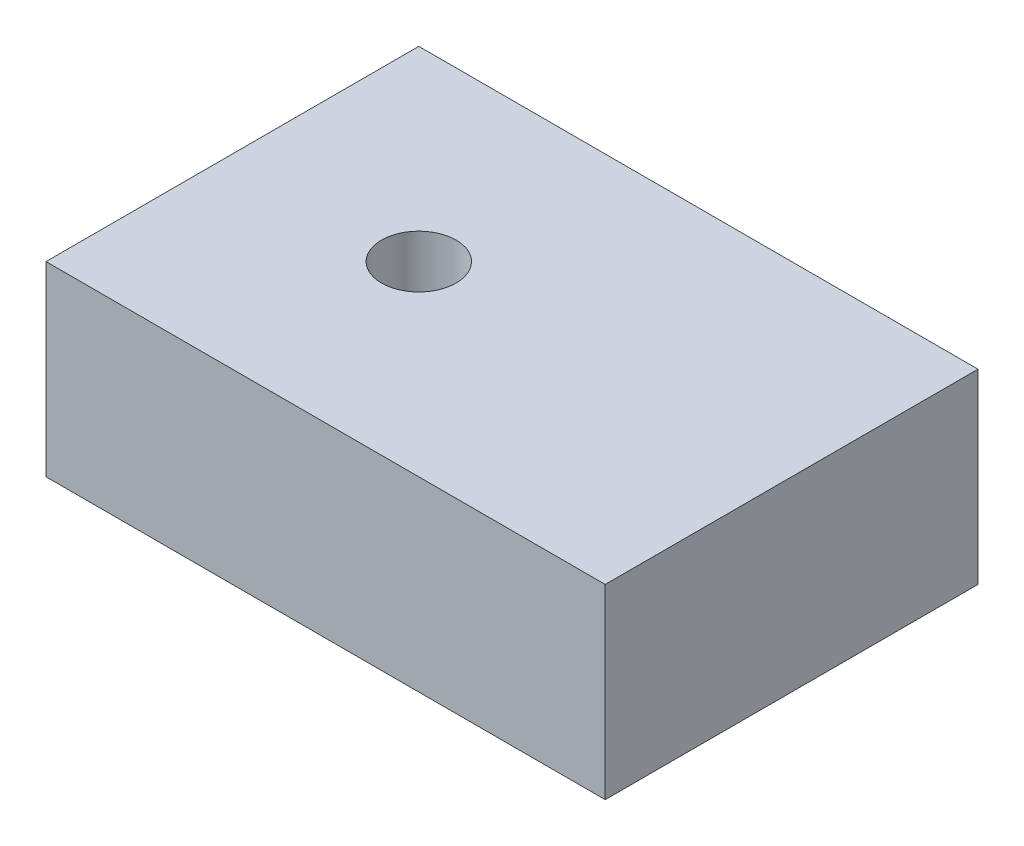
ISO-10303-21;
HEADER;
FILE_DESCRIPTION(('STEP AP214'),'2;1');
FILE_NAME('part.step','',(''),(''),'','','');
FILE_SCHEMA(('AUTOMOTIVE_DESIGN { 1 0 10303 214 1 1 1 1 }'));
ENDSEC;
DATA;
#1=APPLICATION_CONTEXT('core data for automotive mechanical design processes');
#2=APPLICATION_PROTOCOL_DEFINITION('international standard','automotive_design',2000,#1);
#3=PRODUCT_CONTEXT('',#1,'mechanical');
#4=PRODUCT('Part','Part','',(#3));
#5=PRODUCT_RELATED_PRODUCT_CATEGORY('part','',(#4));
#6=PRODUCT_DEFINITION_FORMATION('','',#4);
#7=PRODUCT_DEFINITION_CONTEXT('part definition',#1,'design');
#8=PRODUCT_DEFINITION('design','',#6,#7);
#9=PRODUCT_DEFINITION_SHAPE('','',#8);
#10=(LENGTH_UNIT() NAMED_UNIT(*) SI_UNIT(.MILLI.,.METRE.));
#11=(NAMED_UNIT(*) PLANE_ANGLE_UNIT() SI_UNIT($,.RADIAN.));
#12=(NAMED_UNIT(*) SI_UNIT($,.STERADIAN.) SOLID_ANGLE_UNIT());
#13=UNCERTAINTY_MEASURE_WITH_UNIT(LENGTH_MEASURE(1.E-05),#10,'distance_accuracy_value','');
#14=(GEOMETRIC_REPRESENTATION_CONTEXT(3) GLOBAL_UNCERTAINTY_ASSIGNED_CONTEXT((#13)) GLOBAL_UNIT_ASSIGNED_CONTEXT((#10,
#11,#12)) REPRESENTATION_CONTEXT('',''));
#15=CARTESIAN_POINT('',(0.,0.,0.));
#16=DIRECTION('',(0.,0.,1.));
#17=DIRECTION('',(1.,0.,0.));
#18=AXIS2_PLACEMENT_3D('',#15,#16,#17);
#19=CARTESIAN_POINT('',(-30.,10.,-20.));
#20=DIRECTION('',(1.,0.,0.));
#21=DIRECTION('',(0.,0.,-1.));
#22=AXIS2_PLACEMENT_3D('',#19,#20,#21);
#23=PLANE('',#22);
#24=DIRECTION('',(0.,0.,1.));
#25=VECTOR('',#24,1.);
#26=CARTESIAN_POINT('',(-30.,0.,-20.));
#27=LINE('',#26,#25);
#28=CARTESIAN_POINT('',(-30.,0.,-20.));
#29=VERTEX_POINT('',#28);
#30=CARTESIAN_POINT('',(-30.,0.,0.));
#31=VERTEX_POINT('',#30);
#32=EDGE_CURVE('E94',#29,#31,#27,.T.);
#33=ORIENTED_EDGE('',*,*,#32,.T.);
#34=DIRECTION('',(0.,-1.,0.));
#35=VECTOR('',#34,1.);
#36=CARTESIAN_POINT('',(-30.,10.,0.));
#37=LINE('',#36,#35);
#38=CARTESIAN_POINT('',(-30.,10.,0.));
#39=VERTEX_POINT('',#38);
#40=EDGE_CURVE('E11',#39,#31,#37,.T.);
#41=ORIENTED_EDGE('',*,*,#40,.F.);
#42=DIRECTION('',(0.,0.,1.));
#43=VECTOR('',#42,1.);
#44=CARTESIAN_POINT('',(-30.,10.,-20.));
#45=LINE('',#44,#43);
#46=CARTESIAN_POINT('',(-30.,10.,-20.));
#47=VERTEX_POINT('',#46);
#48=EDGE_CURVE('E82',#47,#39,#45,.T.);
#49=ORIENTED_EDGE('',*,*,#48,.F.);
#50=DIRECTION('',(0.,-1.,0.));
#51=VECTOR('',#50,1.);
#52=CARTESIAN_POINT('',(-30.,10.,-20.));
#53=LINE('',#52,#51);
#54=EDGE_CURVE('E90',#47,#29,#53,.T.);
#55=ORIENTED_EDGE('',*,*,#54,.T.);
#56=EDGE_LOOP('',(#33,#41,#49,#55));
#57=FACE_BOUND('',#56,.T.);
#58=ADVANCED_FACE('F31',(#57),#23,.F.);
#59=CARTESIAN_POINT('',(-30.,10.,0.));
#60=DIRECTION('',(0.,0.,-1.));
#61=DIRECTION('',(-1.,0.,0.));
#62=AXIS2_PLACEMENT_3D('',#59,#60,#61);
#63=PLANE('',#62);
#64=DIRECTION('',(1.,0.,0.));
#65=VECTOR('',#64,1.);
#66=CARTESIAN_POINT('',(-30.,0.,0.));
#67=LINE('',#66,#65);
#68=CARTESIAN_POINT('',(0.,0.,0.));
#69=VERTEX_POINT('',#68);
#70=EDGE_CURVE('E86',#31,#69,#67,.T.);
#71=ORIENTED_EDGE('',*,*,#70,.T.);
#72=DIRECTION('',(0.,-1.,0.));
#73=VECTOR('',#72,1.);
#74=CARTESIAN_POINT('',(0.,10.,0.));
#75=LINE('',#74,#73);
#76=CARTESIAN_POINT('',(0.,10.,0.));
#77=VERTEX_POINT('',#76);
#78=EDGE_CURVE('E39',#77,#69,#75,.T.);
#79=ORIENTED_EDGE('',*,*,#78,.F.);
#80=DIRECTION('',(1.,0.,0.));
#81=VECTOR('',#80,1.);
#82=CARTESIAN_POINT('',(-30.,10.,0.));
#83=LINE('',#82,#81);
#84=EDGE_CURVE('E77',#39,#77,#83,.T.);
#85=ORIENTED_EDGE('',*,*,#84,.F.);
#86=ORIENTED_EDGE('',*,*,#40,.T.);
#87=EDGE_LOOP('',(#71,#79,#85,#86));
#88=FACE_BOUND('',#87,.T.);
#89=ADVANCED_FACE('F85',(#88),#63,.F.);
#90=CARTESIAN_POINT('',(0.,10.,-20.));
#91=DIRECTION('',(-1.,0.,0.));
#92=DIRECTION('',(0.,0.,1.));
#93=AXIS2_PLACEMENT_3D('',#90,#91,#92);
#94=PLANE('',#93);
#95=DIRECTION('',(0.,0.,-1.));
#96=VECTOR('',#95,1.);
#97=CARTESIAN_POINT('',(0.,0.,-20.));
#98=LINE('',#97,#96);
#99=CARTESIAN_POINT('',(0.,0.,-20.));
#100=VERTEX_POINT('',#99);
#101=EDGE_CURVE('E64',#69,#100,#98,.T.);
#102=ORIENTED_EDGE('',*,*,#101,.T.);
#103=DIRECTION('',(0.,-1.,0.));
#104=VECTOR('',#103,1.);
#105=CARTESIAN_POINT('',(0.,10.,-20.));
#106=LINE('',#105,#104);
#107=CARTESIAN_POINT('',(0.,10.,-20.));
#108=VERTEX_POINT('',#107);
#109=EDGE_CURVE('E87',#108,#100,#106,.T.);
#110=ORIENTED_EDGE('',*,*,#109,.F.);
#111=DIRECTION('',(0.,0.,-1.));
#112=VECTOR('',#111,1.);
#113=CARTESIAN_POINT('',(0.,10.,-20.));
#114=LINE('',#113,#112);
#115=EDGE_CURVE('E80',#77,#108,#114,.T.);
#116=ORIENTED_EDGE('',*,*,#115,.F.);
#117=ORIENTED_EDGE('',*,*,#78,.T.);
#118=EDGE_LOOP('',(#102,#110,#116,#117));
#119=FACE_BOUND('',#118,.T.);
#120=ADVANCED_FACE('F88',(#119),#94,.F.);
#121=CARTESIAN_POINT('',(-30.,10.,-20.));
#122=DIRECTION('',(0.,0.,1.));
#123=DIRECTION('',(1.,0.,0.));
#124=AXIS2_PLACEMENT_3D('',#121,#122,#123);
#125=PLANE('',#124);
#126=DIRECTION('',(-1.,0.,0.));
#127=VECTOR('',#126,1.);
#128=CARTESIAN_POINT('',(-30.,0.,-20.));
#129=LINE('',#128,#127);
#130=EDGE_CURVE('E70',#100,#29,#129,.T.);
#131=ORIENTED_EDGE('',*,*,#130,.T.);
#132=ORIENTED_EDGE('',*,*,#54,.F.);
#133=DIRECTION('',(-1.,0.,0.));
#134=VECTOR('',#133,1.);
#135=CARTESIAN_POINT('',(-30.,10.,-20.));
#136=LINE('',#135,#134);
#137=EDGE_CURVE('E47',#108,#47,#136,.T.);
#138=ORIENTED_EDGE('',*,*,#137,.F.);
#139=ORIENTED_EDGE('',*,*,#109,.T.);
#140=EDGE_LOOP('',(#131,#132,#138,#139));
#141=FACE_BOUND('',#140,.T.);
#142=ADVANCED_FACE('F102',(#141),#125,.F.);
#143=CARTESIAN_POINT('',(-30.,10.,0.));
#144=DIRECTION('',(0.,1.,0.));
#145=DIRECTION('',(0.,0.,1.));
#146=AXIS2_PLACEMENT_3D('',#143,#144,#145);
#147=PLANE('',#146);
#148=CARTESIAN_POINT('',(-20.,10.,-10.));
#149=DIRECTION('',(0.,1.,0.));
#150=DIRECTION('',(0.,0.,1.));
#151=AXIS2_PLACEMENT_3D('',#148,#149,#150);
#152=CIRCLE('',#151,2.);
#153=CARTESIAN_POINT('',(-20.,10.,-8.));
#154=VERTEX_POINT('',#153);
#155=EDGE_CURVE('E108',#154,#154,#152,.T.);
#156=ORIENTED_EDGE('',*,*,#155,.F.);
#157=EDGE_LOOP('',(#156));
#158=FACE_BOUND('',#157,.T.);
#159=ORIENTED_EDGE('',*,*,#48,.T.);
#160=ORIENTED_EDGE('',*,*,#84,.T.);
#161=ORIENTED_EDGE('',*,*,#115,.T.);
#162=ORIENTED_EDGE('',*,*,#137,.T.);
#163=EDGE_LOOP('',(#159,#160,#161,#162));
#164=FACE_BOUND('',#163,.T.);
#165=ADVANCED_FACE('F78',(#158,#164),#147,.T.);
#166=CARTESIAN_POINT('',(-30.,0.,0.));
#167=DIRECTION('',(0.,1.,0.));
#168=DIRECTION('',(0.,0.,1.));
#169=AXIS2_PLACEMENT_3D('',#166,#167,#168);
#170=PLANE('',#169);
#171=CARTESIAN_POINT('',(-20.,0.,-10.));
#172=DIRECTION('',(0.,1.,0.));
#173=DIRECTION('',(0.,0.,1.));
#174=AXIS2_PLACEMENT_3D('',#171,#172,#173);
#175=CIRCLE('',#174,2.);
#176=CARTESIAN_POINT('',(-20.,0.,-8.));
#177=VERTEX_POINT('',#176);
#178=EDGE_CURVE('E97',#177,#177,#175,.T.);
#179=ORIENTED_EDGE('',*,*,#178,.T.);
#180=EDGE_LOOP('',(#179));
#181=FACE_BOUND('',#180,.T.);
#182=ORIENTED_EDGE('',*,*,#32,.F.);
#183=ORIENTED_EDGE('',*,*,#130,.F.);
#184=ORIENTED_EDGE('',*,*,#101,.F.);
#185=ORIENTED_EDGE('',*,*,#70,.F.);
#186=EDGE_LOOP('',(#182,#183,#184,#185));
#187=FACE_BOUND('',#186,.T.);
#188=ADVANCED_FACE('F105',(#181,#187),#170,.F.);
#189=CARTESIAN_POINT('',(-20.,0.,-10.));
#190=DIRECTION('',(0.,1.,0.));
#191=DIRECTION('',(0.,0.,1.));
#192=AXIS2_PLACEMENT_3D('',#189,#190,#191);
#193=CYLINDRICAL_SURFACE('',#192,2.);
#194=ORIENTED_EDGE('',*,*,#178,.F.);
#195=EDGE_LOOP('',(#194));
#196=FACE_BOUND('',#195,.T.);
#197=ORIENTED_EDGE('',*,*,#155,.T.);
#198=EDGE_LOOP('',(#197));
#199=FACE_BOUND('',#198,.T.);
#200=ADVANCED_FACE('F115',(#196,#199),#193,.F.);
#201=CLOSED_SHELL('',(#58,#89,#120,#142,#165,#188,#200));
#202=MANIFOLD_SOLID_BREP('B2',#201);
#203=ADVANCED_BREP_SHAPE_REPRESENTATION('',(#18,#202),#14);
#204=SHAPE_DEFINITION_REPRESENTATION(#9,#203);
ENDSEC;
END-ISO-10303-21;
